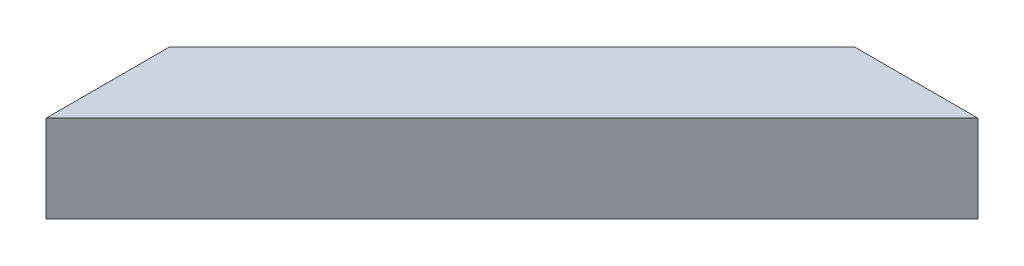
ISO-10303-21;
HEADER;
FILE_DESCRIPTION(('STEP AP214'),'2;1');
FILE_NAME('part.step','',(''),(''),'','','');
FILE_SCHEMA(('AUTOMOTIVE_DESIGN { 1 0 10303 214 1 1 1 1 }'));
ENDSEC;
DATA;
#1=APPLICATION_CONTEXT('core data for automotive mechanical design processes');
#2=APPLICATION_PROTOCOL_DEFINITION('international standard','automotive_design',2000,#1);
#3=PRODUCT_CONTEXT('',#1,'mechanical');
#4=PRODUCT('Part','Part','',(#3));
#5=PRODUCT_RELATED_PRODUCT_CATEGORY('part','',(#4));
#6=PRODUCT_DEFINITION_FORMATION('','',#4);
#7=PRODUCT_DEFINITION_CONTEXT('part definition',#1,'design');
#8=PRODUCT_DEFINITION('design','',#6,#7);
#9=PRODUCT_DEFINITION_SHAPE('','',#8);
#10=(LENGTH_UNIT() NAMED_UNIT(*) SI_UNIT(.MILLI.,.METRE.));
#11=(NAMED_UNIT(*) PLANE_ANGLE_UNIT() SI_UNIT($,.RADIAN.));
#12=(NAMED_UNIT(*) SI_UNIT($,.STERADIAN.) SOLID_ANGLE_UNIT());
#13=UNCERTAINTY_MEASURE_WITH_UNIT(LENGTH_MEASURE(1.E-05),#10,'distance_accuracy_value','');
#14=(GEOMETRIC_REPRESENTATION_CONTEXT(3) GLOBAL_UNCERTAINTY_ASSIGNED_CONTEXT((#13)) GLOBAL_UNIT_ASSIGNED_CONTEXT((#10,
#11,#12)) REPRESENTATION_CONTEXT('',''));
#15=CARTESIAN_POINT('',(0.,0.,0.));
#16=DIRECTION('',(0.,0.,1.));
#17=DIRECTION('',(1.,0.,0.));
#18=AXIS2_PLACEMENT_3D('',#15,#16,#17);
#19=CARTESIAN_POINT('',(-42.4264068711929,60.,-42.4264068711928));
#20=DIRECTION('',(-0.707106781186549,0.,-0.707106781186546));
#21=DIRECTION('',(-0.707106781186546,0.,0.707106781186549));
#22=AXIS2_PLACEMENT_3D('',#19,#20,#21);
#23=PLANE('',#22);
#24=DIRECTION('',(0.707106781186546,0.,-0.707106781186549));
#25=VECTOR('',#24,1.);
#26=CARTESIAN_POINT('',(-42.4264068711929,0.,-42.4264068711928));
#27=LINE('',#26,#25);
#28=CARTESIAN_POINT('',(-160.,0.,75.1471862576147));
#29=VERTEX_POINT('',#28);
#30=CARTESIAN_POINT('',(75.1471862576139,0.,-160.));
#31=VERTEX_POINT('',#30);
#32=EDGE_CURVE('E118',#29,#31,#27,.T.);
#33=ORIENTED_EDGE('',*,*,#32,.F.);
#34=DIRECTION('',(0.,-1.,0.));
#35=VECTOR('',#34,1.);
#36=CARTESIAN_POINT('',(-160.,60.,75.1471862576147));
#37=LINE('',#36,#35);
#38=CARTESIAN_POINT('',(-160.,60.,75.1471862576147));
#39=VERTEX_POINT('',#38);
#40=EDGE_CURVE('E11',#39,#29,#37,.T.);
#41=ORIENTED_EDGE('',*,*,#40,.F.);
#42=DIRECTION('',(0.707106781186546,0.,-0.707106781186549));
#43=VECTOR('',#42,1.);
#44=CARTESIAN_POINT('',(-42.4264068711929,60.,-42.4264068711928));
#45=LINE('',#44,#43);
#46=CARTESIAN_POINT('',(75.1471862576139,60.,-160.));
#47=VERTEX_POINT('',#46);
#48=EDGE_CURVE('E98',#39,#47,#45,.T.);
#49=ORIENTED_EDGE('',*,*,#48,.T.);
#50=DIRECTION('',(0.,-1.,0.));
#51=VECTOR('',#50,1.);
#52=CARTESIAN_POINT('',(75.1471862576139,60.,-160.));
#53=LINE('',#52,#51);
#54=EDGE_CURVE('E66',#47,#31,#53,.T.);
#55=ORIENTED_EDGE('',*,*,#54,.T.);
#56=EDGE_LOOP('',(#33,#41,#49,#55));
#57=FACE_BOUND('',#56,.T.);
#58=ADVANCED_FACE('F49',(#57),#23,.T.);
#59=CARTESIAN_POINT('',(-160.,60.,0.));
#60=DIRECTION('',(1.,0.,0.));
#61=DIRECTION('',(0.,0.,-1.));
#62=AXIS2_PLACEMENT_3D('',#59,#60,#61);
#63=PLANE('',#62);
#64=DIRECTION('',(0.,0.,1.));
#65=VECTOR('',#64,1.);
#66=CARTESIAN_POINT('',(-160.,0.,0.));
#67=LINE('',#66,#65);
#68=CARTESIAN_POINT('',(-160.,0.,160.));
#69=VERTEX_POINT('',#68);
#70=EDGE_CURVE('E105',#29,#69,#67,.T.);
#71=ORIENTED_EDGE('',*,*,#70,.T.);
#72=DIRECTION('',(0.,-1.,0.));
#73=VECTOR('',#72,1.);
#74=CARTESIAN_POINT('',(-160.,60.,160.));
#75=LINE('',#74,#73);
#76=CARTESIAN_POINT('',(-160.,60.,160.));
#77=VERTEX_POINT('',#76);
#78=EDGE_CURVE('E58',#77,#69,#75,.T.);
#79=ORIENTED_EDGE('',*,*,#78,.F.);
#80=DIRECTION('',(0.,0.,1.));
#81=VECTOR('',#80,1.);
#82=CARTESIAN_POINT('',(-160.,60.,0.));
#83=LINE('',#82,#81);
#84=EDGE_CURVE('E92',#39,#77,#83,.T.);
#85=ORIENTED_EDGE('',*,*,#84,.F.);
#86=ORIENTED_EDGE('',*,*,#40,.T.);
#87=EDGE_LOOP('',(#71,#79,#85,#86));
#88=FACE_BOUND('',#87,.T.);
#89=ADVANCED_FACE('F103',(#88),#63,.F.);
#90=CARTESIAN_POINT('',(0.,60.,0.));
#91=DIRECTION('',(-0.707106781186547,0.,-0.707106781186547));
#92=DIRECTION('',(-0.707106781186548,0.,0.707106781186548));
#93=AXIS2_PLACEMENT_3D('',#90,#91,#92);
#94=PLANE('',#93);
#95=DIRECTION('',(0.707106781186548,0.,-0.707106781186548));
#96=VECTOR('',#95,1.);
#97=CARTESIAN_POINT('',(0.,0.,0.));
#98=LINE('',#97,#96);
#99=CARTESIAN_POINT('',(160.,0.,-160.));
#100=VERTEX_POINT('',#99);
#101=EDGE_CURVE('E123',#69,#100,#98,.T.);
#102=ORIENTED_EDGE('',*,*,#101,.T.);
#103=DIRECTION('',(0.,-1.,0.));
#104=VECTOR('',#103,1.);
#105=CARTESIAN_POINT('',(160.,60.,-160.));
#106=LINE('',#105,#104);
#107=CARTESIAN_POINT('',(160.,60.,-160.));
#108=VERTEX_POINT('',#107);
#109=EDGE_CURVE('E80',#108,#100,#106,.T.);
#110=ORIENTED_EDGE('',*,*,#109,.F.);
#111=DIRECTION('',(0.707106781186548,0.,-0.707106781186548));
#112=VECTOR('',#111,1.);
#113=CARTESIAN_POINT('',(0.,60.,0.));
#114=LINE('',#113,#112);
#115=EDGE_CURVE('E97',#77,#108,#114,.T.);
#116=ORIENTED_EDGE('',*,*,#115,.F.);
#117=ORIENTED_EDGE('',*,*,#78,.T.);
#118=EDGE_LOOP('',(#102,#110,#116,#117));
#119=FACE_BOUND('',#118,.T.);
#120=ADVANCED_FACE('F109',(#119),#94,.F.);
#121=CARTESIAN_POINT('',(0.,60.,-160.));
#122=DIRECTION('',(0.,0.,-1.));
#123=DIRECTION('',(-1.,0.,0.));
#124=AXIS2_PLACEMENT_3D('',#121,#122,#123);
#125=PLANE('',#124);
#126=DIRECTION('',(1.,0.,0.));
#127=VECTOR('',#126,1.);
#128=CARTESIAN_POINT('',(0.,0.,-160.));
#129=LINE('',#128,#127);
#130=EDGE_CURVE('E126',#31,#100,#129,.T.);
#131=ORIENTED_EDGE('',*,*,#130,.F.);
#132=ORIENTED_EDGE('',*,*,#54,.F.);
#133=DIRECTION('',(1.,0.,0.));
#134=VECTOR('',#133,1.);
#135=CARTESIAN_POINT('',(0.,60.,-160.));
#136=LINE('',#135,#134);
#137=EDGE_CURVE('E111',#47,#108,#136,.T.);
#138=ORIENTED_EDGE('',*,*,#137,.T.);
#139=ORIENTED_EDGE('',*,*,#109,.T.);
#140=EDGE_LOOP('',(#131,#132,#138,#139));
#141=FACE_BOUND('',#140,.T.);
#142=ADVANCED_FACE('F142',(#141),#125,.T.);
#143=CARTESIAN_POINT('',(0.,60.,0.));
#144=DIRECTION('',(0.,1.,0.));
#145=DIRECTION('',(0.,0.,1.));
#146=AXIS2_PLACEMENT_3D('',#143,#144,#145);
#147=PLANE('',#146);
#148=ORIENTED_EDGE('',*,*,#48,.F.);
#149=ORIENTED_EDGE('',*,*,#84,.T.);
#150=ORIENTED_EDGE('',*,*,#115,.T.);
#151=ORIENTED_EDGE('',*,*,#137,.F.);
#152=EDGE_LOOP('',(#148,#149,#150,#151));
#153=FACE_BOUND('',#152,.T.);
#154=ADVANCED_FACE('F94',(#153),#147,.T.);
#155=CARTESIAN_POINT('',(0.,0.,0.));
#156=DIRECTION('',(0.,1.,0.));
#157=DIRECTION('',(0.,0.,1.));
#158=AXIS2_PLACEMENT_3D('',#155,#156,#157);
#159=PLANE('',#158);
#160=ORIENTED_EDGE('',*,*,#32,.T.);
#161=ORIENTED_EDGE('',*,*,#130,.T.);
#162=ORIENTED_EDGE('',*,*,#101,.F.);
#163=ORIENTED_EDGE('',*,*,#70,.F.);
#164=EDGE_LOOP('',(#160,#161,#162,#163));
#165=FACE_BOUND('',#164,.T.);
#166=ADVANCED_FACE('F149',(#165),#159,.F.);
#167=CLOSED_SHELL('',(#58,#89,#120,#142,#154,#166));
#168=MANIFOLD_SOLID_BREP('B2',#167);
#169=ADVANCED_BREP_SHAPE_REPRESENTATION('',(#18,#168),#14);
#170=SHAPE_DEFINITION_REPRESENTATION(#9,#169);
ENDSEC;
END-ISO-10303-21;
